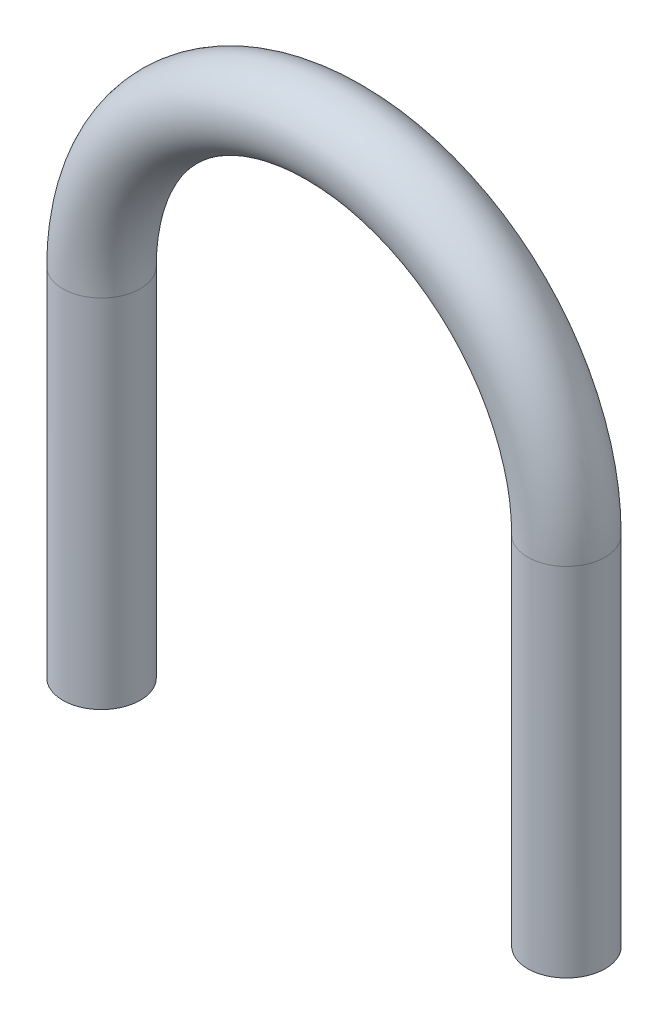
ISO-10303-21;
HEADER;
FILE_DESCRIPTION(('STEP AP214'),'2;1');
FILE_NAME('part.step','',(''),(''),'','','');
FILE_SCHEMA(('AUTOMOTIVE_DESIGN { 1 0 10303 214 1 1 1 1 }'));
ENDSEC;
DATA;
#1=APPLICATION_CONTEXT('core data for automotive mechanical design processes');
#2=APPLICATION_PROTOCOL_DEFINITION('international standard','automotive_design',2000,#1);
#3=PRODUCT_CONTEXT('',#1,'mechanical');
#4=PRODUCT('Part','Part','',(#3));
#5=PRODUCT_RELATED_PRODUCT_CATEGORY('part','',(#4));
#6=PRODUCT_DEFINITION_FORMATION('','',#4);
#7=PRODUCT_DEFINITION_CONTEXT('part definition',#1,'design');
#8=PRODUCT_DEFINITION('design','',#6,#7);
#9=PRODUCT_DEFINITION_SHAPE('','',#8);
#10=(LENGTH_UNIT() NAMED_UNIT(*) SI_UNIT(.MILLI.,.METRE.));
#11=(NAMED_UNIT(*) PLANE_ANGLE_UNIT() SI_UNIT($,.RADIAN.));
#12=(NAMED_UNIT(*) SI_UNIT($,.STERADIAN.) SOLID_ANGLE_UNIT());
#13=UNCERTAINTY_MEASURE_WITH_UNIT(LENGTH_MEASURE(1.E-05),#10,'distance_accuracy_value','');
#14=(GEOMETRIC_REPRESENTATION_CONTEXT(3) GLOBAL_UNCERTAINTY_ASSIGNED_CONTEXT((#13)) GLOBAL_UNIT_ASSIGNED_CONTEXT((#10,
#11,#12)) REPRESENTATION_CONTEXT('',''));
#15=CARTESIAN_POINT('',(0.,0.,0.));
#16=DIRECTION('',(0.,0.,1.));
#17=DIRECTION('',(1.,0.,0.));
#18=AXIS2_PLACEMENT_3D('',#15,#16,#17);
#19=CARTESIAN_POINT('',(-15.,23.,0.));
#20=DIRECTION('',(0.,-1.,0.));
#21=DIRECTION('',(0.,0.,-1.));
#22=AXIS2_PLACEMENT_3D('',#19,#20,#21);
#23=CYLINDRICAL_SURFACE('',#22,2.5);
#24=CARTESIAN_POINT('',(-15.,23.,0.));
#25=DIRECTION('',(0.,-1.,0.));
#26=DIRECTION('',(0.,0.,1.));
#27=AXIS2_PLACEMENT_3D('',#24,#25,#26);
#28=CIRCLE('',#27,2.5);
#29=CARTESIAN_POINT('',(-17.5,23.,0.));
#30=VERTEX_POINT('',#29);
#31=EDGE_CURVE('E30',#30,#30,#28,.T.);
#32=ORIENTED_EDGE('',*,*,#31,.T.);
#33=EDGE_LOOP('',(#32));
#34=FACE_BOUND('',#33,.T.);
#35=CARTESIAN_POINT('',(-15.,0.,0.));
#36=DIRECTION('',(0.,-1.,0.));
#37=DIRECTION('',(0.,0.,1.));
#38=AXIS2_PLACEMENT_3D('',#35,#36,#37);
#39=CIRCLE('',#38,2.5);
#40=CARTESIAN_POINT('',(-15.,0.,2.5));
#41=VERTEX_POINT('',#40);
#42=EDGE_CURVE('E10',#41,#41,#39,.T.);
#43=ORIENTED_EDGE('',*,*,#42,.F.);
#44=EDGE_LOOP('',(#43));
#45=FACE_BOUND('',#44,.T.);
#46=ADVANCED_FACE('F24',(#34,#45),#23,.T.);
#47=CARTESIAN_POINT('',(0.,23.,0.));
#48=DIRECTION('',(0.,0.,1.));
#49=DIRECTION('',(1.,0.,0.));
#50=AXIS2_PLACEMENT_3D('',#47,#48,#49);
#51=TOROIDAL_SURFACE('',#50,15.,2.5);
#52=CARTESIAN_POINT('',(15.,23.,0.));
#53=DIRECTION('',(0.,1.,0.));
#54=DIRECTION('',(0.,0.,1.));
#55=AXIS2_PLACEMENT_3D('',#52,#53,#54);
#56=CIRCLE('',#55,2.5);
#57=CARTESIAN_POINT('',(17.5,23.,0.));
#58=VERTEX_POINT('',#57);
#59=EDGE_CURVE('E34',#58,#58,#56,.T.);
#60=CARTESIAN_POINT('',(0.,23.,0.));
#61=DIRECTION('',(0.,0.,1.));
#62=DIRECTION('',(1.,0.,0.));
#63=AXIS2_PLACEMENT_3D('',#60,#61,#62);
#64=CIRCLE('',#63,17.5);
#65=EDGE_CURVE('',#58,#30,#64,.T.);
#66=ORIENTED_EDGE('',*,*,#59,.T.);
#67=ORIENTED_EDGE('',*,*,#31,.F.);
#68=ORIENTED_EDGE('',*,*,#65,.T.);
#69=ORIENTED_EDGE('',*,*,#65,.F.);
#70=EDGE_LOOP('',(#66,#68,#67,#69));
#71=FACE_BOUND('',#70,.T.);
#72=ADVANCED_FACE('F55',(#71),#51,.T.);
#73=CARTESIAN_POINT('',(15.,23.,0.));
#74=DIRECTION('',(0.,-1.,0.));
#75=DIRECTION('',(0.,0.,-1.));
#76=AXIS2_PLACEMENT_3D('',#73,#74,#75);
#77=CYLINDRICAL_SURFACE('',#76,2.5);
#78=ORIENTED_EDGE('',*,*,#59,.F.);
#79=EDGE_LOOP('',(#78));
#80=FACE_BOUND('',#79,.T.);
#81=CARTESIAN_POINT('',(15.,0.,0.));
#82=DIRECTION('',(0.,1.,0.));
#83=DIRECTION('',(0.,0.,1.));
#84=AXIS2_PLACEMENT_3D('',#81,#82,#83);
#85=CIRCLE('',#84,2.5);
#86=CARTESIAN_POINT('',(15.,0.,2.5));
#87=VERTEX_POINT('',#86);
#88=EDGE_CURVE('E38',#87,#87,#85,.T.);
#89=ORIENTED_EDGE('',*,*,#88,.T.);
#90=EDGE_LOOP('',(#89));
#91=FACE_BOUND('',#90,.T.);
#92=ADVANCED_FACE('F44',(#80,#91),#77,.T.);
#93=CARTESIAN_POINT('',(-15.,0.,0.));
#94=DIRECTION('',(0.,-1.,0.));
#95=DIRECTION('',(0.,0.,1.));
#96=AXIS2_PLACEMENT_3D('',#93,#94,#95);
#97=PLANE('',#96);
#98=ORIENTED_EDGE('',*,*,#42,.T.);
#99=EDGE_LOOP('',(#98));
#100=FACE_BOUND('',#99,.T.);
#101=ADVANCED_FACE('F48',(#100),#97,.T.);
#102=CARTESIAN_POINT('',(15.,0.,0.));
#103=DIRECTION('',(0.,1.,0.));
#104=DIRECTION('',(0.,0.,1.));
#105=AXIS2_PLACEMENT_3D('',#102,#103,#104);
#106=PLANE('',#105);
#107=ORIENTED_EDGE('',*,*,#88,.F.);
#108=EDGE_LOOP('',(#107));
#109=FACE_BOUND('',#108,.T.);
#110=ADVANCED_FACE('F46',(#109),#106,.F.);
#111=CLOSED_SHELL('',(#46,#72,#92,#101,#110));
#112=MANIFOLD_SOLID_BREP('B2',#111);
#113=ADVANCED_BREP_SHAPE_REPRESENTATION('',(#18,#112),#14);
#114=SHAPE_DEFINITION_REPRESENTATION(#9,#113);
ENDSEC;
END-ISO-10303-21;
